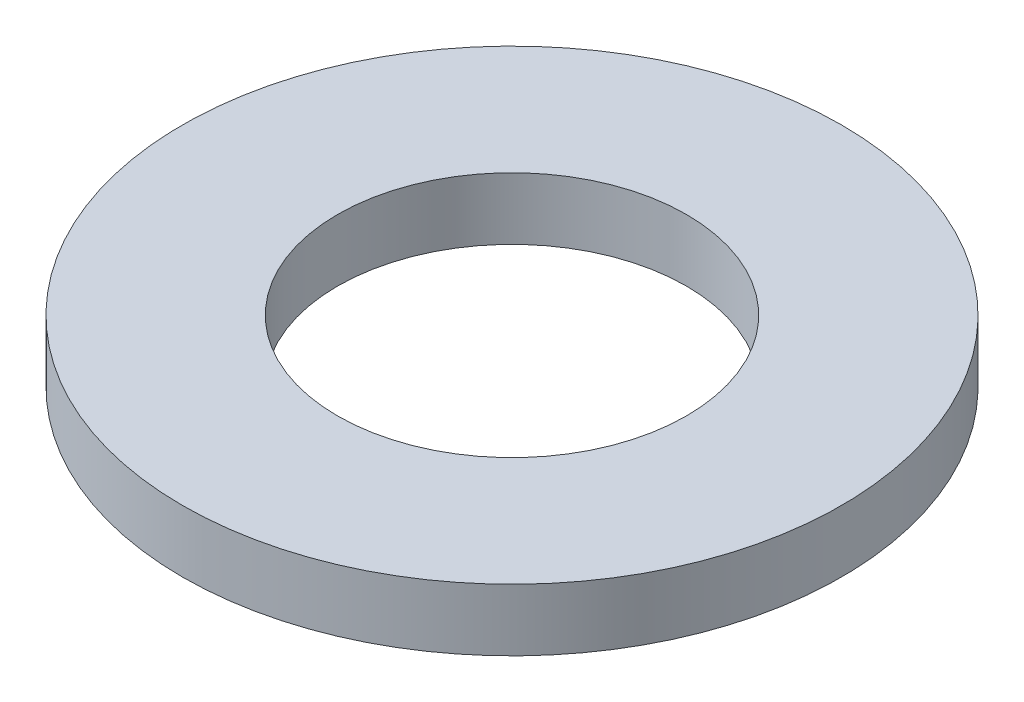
ISO-10303-21;
HEADER;
FILE_DESCRIPTION(('STEP AP214'),'2;1');
FILE_NAME('part.step','',(''),(''),'','','');
FILE_SCHEMA(('AUTOMOTIVE_DESIGN { 1 0 10303 214 1 1 1 1 }'));
ENDSEC;
DATA;
#1=APPLICATION_CONTEXT('core data for automotive mechanical design processes');
#2=APPLICATION_PROTOCOL_DEFINITION('international standard','automotive_design',2000,#1);
#3=PRODUCT_CONTEXT('',#1,'mechanical');
#4=PRODUCT('Part','Part','',(#3));
#5=PRODUCT_RELATED_PRODUCT_CATEGORY('part','',(#4));
#6=PRODUCT_DEFINITION_FORMATION('','',#4);
#7=PRODUCT_DEFINITION_CONTEXT('part definition',#1,'design');
#8=PRODUCT_DEFINITION('design','',#6,#7);
#9=PRODUCT_DEFINITION_SHAPE('','',#8);
#10=(LENGTH_UNIT() NAMED_UNIT(*) SI_UNIT(.MILLI.,.METRE.));
#11=(NAMED_UNIT(*) PLANE_ANGLE_UNIT() SI_UNIT($,.RADIAN.));
#12=(NAMED_UNIT(*) SI_UNIT($,.STERADIAN.) SOLID_ANGLE_UNIT());
#13=UNCERTAINTY_MEASURE_WITH_UNIT(LENGTH_MEASURE(1.E-05),#10,'distance_accuracy_value','');
#14=(GEOMETRIC_REPRESENTATION_CONTEXT(3) GLOBAL_UNCERTAINTY_ASSIGNED_CONTEXT((#13)) GLOBAL_UNIT_ASSIGNED_CONTEXT((#10,
#11,#12)) REPRESENTATION_CONTEXT('',''));
#15=CARTESIAN_POINT('',(0.,0.,0.));
#16=DIRECTION('',(0.,0.,1.));
#17=DIRECTION('',(1.,0.,0.));
#18=AXIS2_PLACEMENT_3D('',#15,#16,#17);
#19=CARTESIAN_POINT('',(0.,0.,0.));
#20=DIRECTION('',(0.,1.,0.));
#21=DIRECTION('',(0.,0.,1.));
#22=AXIS2_PLACEMENT_3D('',#19,#20,#21);
#23=CYLINDRICAL_SURFACE('',#22,4.5);
#24=CARTESIAN_POINT('',(0.,0.,0.));
#25=DIRECTION('',(0.,1.,0.));
#26=DIRECTION('',(0.,0.,1.));
#27=AXIS2_PLACEMENT_3D('',#24,#25,#26);
#28=CIRCLE('',#27,4.5);
#29=CARTESIAN_POINT('',(0.,0.,4.5));
#30=VERTEX_POINT('',#29);
#31=EDGE_CURVE('E10',#30,#30,#28,.T.);
#32=ORIENTED_EDGE('',*,*,#31,.T.);
#33=EDGE_LOOP('',(#32));
#34=FACE_BOUND('',#33,.T.);
#35=CARTESIAN_POINT('',(0.,-1.6,0.));
#36=DIRECTION('',(0.,1.,0.));
#37=DIRECTION('',(0.,0.,1.));
#38=AXIS2_PLACEMENT_3D('',#35,#36,#37);
#39=CIRCLE('',#38,4.5);
#40=CARTESIAN_POINT('',(0.,-1.6,4.5));
#41=VERTEX_POINT('',#40);
#42=EDGE_CURVE('E51',#41,#41,#39,.T.);
#43=ORIENTED_EDGE('',*,*,#42,.F.);
#44=EDGE_LOOP('',(#43));
#45=FACE_BOUND('',#44,.T.);
#46=ADVANCED_FACE('F40',(#34,#45),#23,.F.);
#47=CARTESIAN_POINT('',(4.5,0.,0.));
#48=DIRECTION('',(0.,1.,0.));
#49=DIRECTION('',(0.,0.,1.));
#50=AXIS2_PLACEMENT_3D('',#47,#48,#49);
#51=PLANE('',#50);
#52=CARTESIAN_POINT('',(0.,0.,0.));
#53=DIRECTION('',(0.,1.,0.));
#54=DIRECTION('',(0.,0.,1.));
#55=AXIS2_PLACEMENT_3D('',#52,#53,#54);
#56=CIRCLE('',#55,8.5);
#57=CARTESIAN_POINT('',(0.,0.,8.5));
#58=VERTEX_POINT('',#57);
#59=EDGE_CURVE('E43',#58,#58,#56,.T.);
#60=ORIENTED_EDGE('',*,*,#59,.T.);
#61=EDGE_LOOP('',(#60));
#62=FACE_BOUND('',#61,.T.);
#63=ORIENTED_EDGE('',*,*,#31,.F.);
#64=EDGE_LOOP('',(#63));
#65=FACE_BOUND('',#64,.T.);
#66=ADVANCED_FACE('F62',(#62,#65),#51,.T.);
#67=CARTESIAN_POINT('',(0.,0.,0.));
#68=DIRECTION('',(0.,1.,0.));
#69=DIRECTION('',(0.,0.,1.));
#70=AXIS2_PLACEMENT_3D('',#67,#68,#69);
#71=CYLINDRICAL_SURFACE('',#70,8.5);
#72=CARTESIAN_POINT('',(0.,-1.6,0.));
#73=DIRECTION('',(0.,1.,0.));
#74=DIRECTION('',(0.,0.,1.));
#75=AXIS2_PLACEMENT_3D('',#72,#73,#74);
#76=CIRCLE('',#75,8.5);
#77=CARTESIAN_POINT('',(0.,-1.6,8.5));
#78=VERTEX_POINT('',#77);
#79=EDGE_CURVE('E50',#78,#78,#76,.T.);
#80=ORIENTED_EDGE('',*,*,#79,.T.);
#81=EDGE_LOOP('',(#80));
#82=FACE_BOUND('',#81,.T.);
#83=ORIENTED_EDGE('',*,*,#59,.F.);
#84=EDGE_LOOP('',(#83));
#85=FACE_BOUND('',#84,.T.);
#86=ADVANCED_FACE('F63',(#82,#85),#71,.T.);
#87=CARTESIAN_POINT('',(4.5,-1.6,0.));
#88=DIRECTION('',(0.,-1.,0.));
#89=DIRECTION('',(0.,0.,-1.));
#90=AXIS2_PLACEMENT_3D('',#87,#88,#89);
#91=PLANE('',#90);
#92=ORIENTED_EDGE('',*,*,#42,.T.);
#93=EDGE_LOOP('',(#92));
#94=FACE_BOUND('',#93,.T.);
#95=ORIENTED_EDGE('',*,*,#79,.F.);
#96=EDGE_LOOP('',(#95));
#97=FACE_BOUND('',#96,.T.);
#98=ADVANCED_FACE('F60',(#94,#97),#91,.T.);
#99=CLOSED_SHELL('',(#46,#66,#86,#98));
#100=MANIFOLD_SOLID_BREP('B2',#99);
#101=ADVANCED_BREP_SHAPE_REPRESENTATION('',(#18,#100),#14);
#102=SHAPE_DEFINITION_REPRESENTATION(#9,#101);
ENDSEC;
END-ISO-10303-21;
